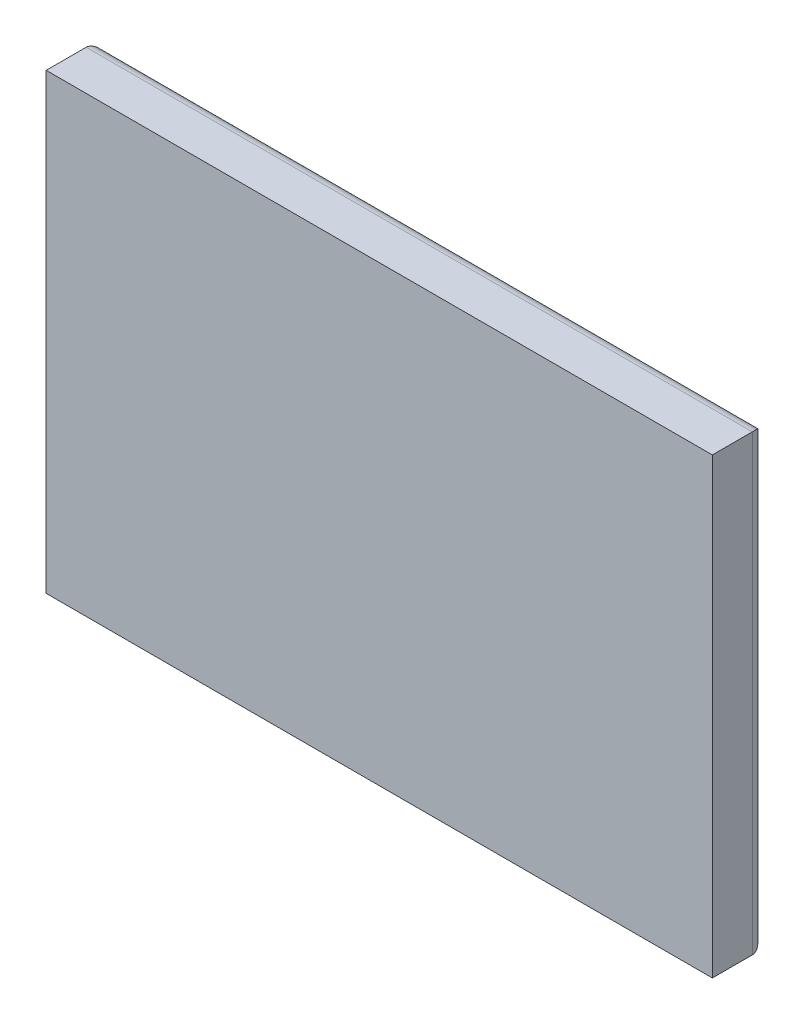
ISO-10303-21;
HEADER;
FILE_DESCRIPTION(('STEP AP214'),'2;1');
FILE_NAME('part.step','',(''),(''),'','','');
FILE_SCHEMA(('AUTOMOTIVE_DESIGN { 1 0 10303 214 1 1 1 1 }'));
ENDSEC;
DATA;
#1=APPLICATION_CONTEXT('core data for automotive mechanical design processes');
#2=APPLICATION_PROTOCOL_DEFINITION('international standard','automotive_design',2000,#1);
#3=PRODUCT_CONTEXT('',#1,'mechanical');
#4=PRODUCT('Part','Part','',(#3));
#5=PRODUCT_RELATED_PRODUCT_CATEGORY('part','',(#4));
#6=PRODUCT_DEFINITION_FORMATION('','',#4);
#7=PRODUCT_DEFINITION_CONTEXT('part definition',#1,'design');
#8=PRODUCT_DEFINITION('design','',#6,#7);
#9=PRODUCT_DEFINITION_SHAPE('','',#8);
#10=(LENGTH_UNIT() NAMED_UNIT(*) SI_UNIT(.MILLI.,.METRE.));
#11=(NAMED_UNIT(*) PLANE_ANGLE_UNIT() SI_UNIT($,.RADIAN.));
#12=(NAMED_UNIT(*) SI_UNIT($,.STERADIAN.) SOLID_ANGLE_UNIT());
#13=UNCERTAINTY_MEASURE_WITH_UNIT(LENGTH_MEASURE(1.E-05),#10,'distance_accuracy_value','');
#14=(GEOMETRIC_REPRESENTATION_CONTEXT(3) GLOBAL_UNCERTAINTY_ASSIGNED_CONTEXT((#13)) GLOBAL_UNIT_ASSIGNED_CONTEXT((#10,
#11,#12)) REPRESENTATION_CONTEXT('',''));
#15=CARTESIAN_POINT('',(0.,0.,0.));
#16=DIRECTION('',(0.,0.,1.));
#17=DIRECTION('',(1.,0.,0.));
#18=AXIS2_PLACEMENT_3D('',#15,#16,#17);
#19=CARTESIAN_POINT('',(15.875,-10.795,2.54));
#20=DIRECTION('',(-1.,0.,0.));
#21=DIRECTION('',(0.,0.,1.));
#22=AXIS2_PLACEMENT_3D('',#19,#20,#21);
#23=PLANE('',#22);
#24=DIRECTION('',(0.,0.,-1.));
#25=VECTOR('',#24,1.);
#26=CARTESIAN_POINT('',(15.875,-10.795,2.54));
#27=LINE('',#26,#25);
#28=CARTESIAN_POINT('',(15.875,-10.795,2.54));
#29=VERTEX_POINT('',#28);
#30=CARTESIAN_POINT('',(15.875,-10.795,0.635));
#31=VERTEX_POINT('',#30);
#32=EDGE_CURVE('E155',#29,#31,#27,.T.);
#33=ORIENTED_EDGE('',*,*,#32,.T.);
#34=DIRECTION('',(0.,1.,0.));
#35=VECTOR('',#34,1.);
#36=CARTESIAN_POINT('',(15.875,10.795,0.635));
#37=LINE('',#36,#35);
#38=CARTESIAN_POINT('',(15.875,10.795,0.635));
#39=VERTEX_POINT('',#38);
#40=EDGE_CURVE('E11',#31,#39,#37,.T.);
#41=ORIENTED_EDGE('',*,*,#40,.T.);
#42=DIRECTION('',(0.,0.,-1.));
#43=VECTOR('',#42,1.);
#44=CARTESIAN_POINT('',(15.875,10.795,2.54));
#45=LINE('',#44,#43);
#46=CARTESIAN_POINT('',(15.875,10.795,2.54));
#47=VERTEX_POINT('',#46);
#48=EDGE_CURVE('E94',#47,#39,#45,.T.);
#49=ORIENTED_EDGE('',*,*,#48,.F.);
#50=DIRECTION('',(0.,1.,0.));
#51=VECTOR('',#50,1.);
#52=CARTESIAN_POINT('',(15.875,-10.795,2.54));
#53=LINE('',#52,#51);
#54=EDGE_CURVE('E101',#29,#47,#53,.T.);
#55=ORIENTED_EDGE('',*,*,#54,.F.);
#56=EDGE_LOOP('',(#33,#41,#49,#55));
#57=FACE_BOUND('',#56,.T.);
#58=ADVANCED_FACE('F36',(#57),#23,.F.);
#59=CARTESIAN_POINT('',(-15.875,10.795,2.54));
#60=DIRECTION('',(0.,-1.,0.));
#61=DIRECTION('',(0.,0.,-1.));
#62=AXIS2_PLACEMENT_3D('',#59,#60,#61);
#63=PLANE('',#62);
#64=ORIENTED_EDGE('',*,*,#48,.T.);
#65=DIRECTION('',(-1.,0.,0.));
#66=VECTOR('',#65,1.);
#67=CARTESIAN_POINT('',(-15.875,10.795,0.635));
#68=LINE('',#67,#66);
#69=CARTESIAN_POINT('',(-15.875,10.795,0.635));
#70=VERTEX_POINT('',#69);
#71=EDGE_CURVE('E45',#39,#70,#68,.T.);
#72=ORIENTED_EDGE('',*,*,#71,.T.);
#73=DIRECTION('',(0.,0.,-1.));
#74=VECTOR('',#73,1.);
#75=CARTESIAN_POINT('',(-15.875,10.795,2.54));
#76=LINE('',#75,#74);
#77=CARTESIAN_POINT('',(-15.875,10.795,2.54));
#78=VERTEX_POINT('',#77);
#79=EDGE_CURVE('E97',#78,#70,#76,.T.);
#80=ORIENTED_EDGE('',*,*,#79,.F.);
#81=DIRECTION('',(-1.,0.,0.));
#82=VECTOR('',#81,1.);
#83=CARTESIAN_POINT('',(-15.875,10.795,2.54));
#84=LINE('',#83,#82);
#85=EDGE_CURVE('E91',#47,#78,#84,.T.);
#86=ORIENTED_EDGE('',*,*,#85,.F.);
#87=EDGE_LOOP('',(#64,#72,#80,#86));
#88=FACE_BOUND('',#87,.T.);
#89=ADVANCED_FACE('F93',(#88),#63,.F.);
#90=CARTESIAN_POINT('',(-15.875,-10.795,2.54));
#91=DIRECTION('',(1.,0.,0.));
#92=DIRECTION('',(0.,0.,-1.));
#93=AXIS2_PLACEMENT_3D('',#90,#91,#92);
#94=PLANE('',#93);
#95=ORIENTED_EDGE('',*,*,#79,.T.);
#96=DIRECTION('',(0.,-1.,0.));
#97=VECTOR('',#96,1.);
#98=CARTESIAN_POINT('',(-15.875,-10.795,0.635));
#99=LINE('',#98,#97);
#100=CARTESIAN_POINT('',(-15.875,-10.795,0.635));
#101=VERTEX_POINT('',#100);
#102=EDGE_CURVE('E108',#70,#101,#99,.T.);
#103=ORIENTED_EDGE('',*,*,#102,.T.);
#104=DIRECTION('',(0.,0.,-1.));
#105=VECTOR('',#104,1.);
#106=CARTESIAN_POINT('',(-15.875,-10.795,2.54));
#107=LINE('',#106,#105);
#108=CARTESIAN_POINT('',(-15.875,-10.795,2.54));
#109=VERTEX_POINT('',#108);
#110=EDGE_CURVE('E113',#109,#101,#107,.T.);
#111=ORIENTED_EDGE('',*,*,#110,.F.);
#112=DIRECTION('',(0.,-1.,0.));
#113=VECTOR('',#112,1.);
#114=CARTESIAN_POINT('',(-15.875,-10.795,2.54));
#115=LINE('',#114,#113);
#116=EDGE_CURVE('E100',#78,#109,#115,.T.);
#117=ORIENTED_EDGE('',*,*,#116,.F.);
#118=EDGE_LOOP('',(#95,#103,#111,#117));
#119=FACE_BOUND('',#118,.T.);
#120=ADVANCED_FACE('F153',(#119),#94,.F.);
#121=CARTESIAN_POINT('',(-15.875,-10.795,2.54));
#122=DIRECTION('',(0.,1.,0.));
#123=DIRECTION('',(0.,0.,1.));
#124=AXIS2_PLACEMENT_3D('',#121,#122,#123);
#125=PLANE('',#124);
#126=ORIENTED_EDGE('',*,*,#110,.T.);
#127=DIRECTION('',(1.,0.,0.));
#128=VECTOR('',#127,1.);
#129=CARTESIAN_POINT('',(15.875,-10.795,0.635));
#130=LINE('',#129,#128);
#131=EDGE_CURVE('E59',#101,#31,#130,.T.);
#132=ORIENTED_EDGE('',*,*,#131,.T.);
#133=ORIENTED_EDGE('',*,*,#32,.F.);
#134=DIRECTION('',(1.,0.,0.));
#135=VECTOR('',#134,1.);
#136=CARTESIAN_POINT('',(-15.875,-10.795,2.54));
#137=LINE('',#136,#135);
#138=EDGE_CURVE('E106',#109,#29,#137,.T.);
#139=ORIENTED_EDGE('',*,*,#138,.F.);
#140=EDGE_LOOP('',(#126,#132,#133,#139));
#141=FACE_BOUND('',#140,.T.);
#142=ADVANCED_FACE('F154',(#141),#125,.F.);
#143=CARTESIAN_POINT('',(0.,0.,2.54));
#144=DIRECTION('',(0.,0.,-1.));
#145=DIRECTION('',(-1.,0.,0.));
#146=AXIS2_PLACEMENT_3D('',#143,#144,#145);
#147=PLANE('',#146);
#148=ORIENTED_EDGE('',*,*,#54,.T.);
#149=ORIENTED_EDGE('',*,*,#85,.T.);
#150=ORIENTED_EDGE('',*,*,#116,.T.);
#151=ORIENTED_EDGE('',*,*,#138,.T.);
#152=EDGE_LOOP('',(#148,#149,#150,#151));
#153=FACE_BOUND('',#152,.T.);
#154=ADVANCED_FACE('F104',(#153),#147,.F.);
#155=CARTESIAN_POINT('',(0.,0.,0.));
#156=DIRECTION('',(0.,0.,-1.));
#157=DIRECTION('',(-1.,0.,0.));
#158=AXIS2_PLACEMENT_3D('',#155,#156,#157);
#159=PLANE('',#158);
#160=DIRECTION('',(1.,0.,0.));
#161=VECTOR('',#160,1.);
#162=CARTESIAN_POINT('',(-15.875,-10.16,0.));
#163=LINE('',#162,#161);
#164=CARTESIAN_POINT('',(15.24,-10.16,0.));
#165=VERTEX_POINT('',#164);
#166=CARTESIAN_POINT('',(-15.24,-10.16,0.));
#167=VERTEX_POINT('',#166);
#168=EDGE_CURVE('E120',#165,#167,#163,.F.);
#169=ORIENTED_EDGE('',*,*,#168,.T.);
#170=DIRECTION('',(0.,-1.,0.));
#171=VECTOR('',#170,1.);
#172=CARTESIAN_POINT('',(-15.24,10.795,0.));
#173=LINE('',#172,#171);
#174=CARTESIAN_POINT('',(-15.24,10.16,0.));
#175=VERTEX_POINT('',#174);
#176=EDGE_CURVE('E122',#167,#175,#173,.F.);
#177=ORIENTED_EDGE('',*,*,#176,.T.);
#178=DIRECTION('',(-1.,0.,0.));
#179=VECTOR('',#178,1.);
#180=CARTESIAN_POINT('',(15.875,10.16,0.));
#181=LINE('',#180,#179);
#182=CARTESIAN_POINT('',(15.24,10.16,0.));
#183=VERTEX_POINT('',#182);
#184=EDGE_CURVE('E118',#175,#183,#181,.F.);
#185=ORIENTED_EDGE('',*,*,#184,.T.);
#186=DIRECTION('',(0.,1.,0.));
#187=VECTOR('',#186,1.);
#188=CARTESIAN_POINT('',(15.24,-10.795,0.));
#189=LINE('',#188,#187);
#190=EDGE_CURVE('E111',#183,#165,#189,.F.);
#191=ORIENTED_EDGE('',*,*,#190,.T.);
#192=EDGE_LOOP('',(#169,#177,#185,#191));
#193=FACE_BOUND('',#192,.T.);
#194=ADVANCED_FACE('F144',(#193),#159,.T.);
#195=CARTESIAN_POINT('',(15.24,-10.795,0.635));
#196=DIRECTION('',(0.,-1.,0.));
#197=DIRECTION('',(0.,0.,-1.));
#198=AXIS2_PLACEMENT_3D('',#195,#196,#197);
#199=CYLINDRICAL_SURFACE('',#198,0.635);
#200=CARTESIAN_POINT('',(15.24,-10.16,0.635));
#201=DIRECTION('',(-0.707106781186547,-0.707106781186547,0.));
#202=DIRECTION('',(0.707106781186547,-0.707106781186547,0.));
#203=AXIS2_PLACEMENT_3D('',#200,#201,#202);
#204=ELLIPSE('',#203,0.898025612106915,0.635);
#205=EDGE_CURVE('E130',#165,#31,#204,.T.);
#206=ORIENTED_EDGE('',*,*,#205,.F.);
#207=ORIENTED_EDGE('',*,*,#190,.F.);
#208=CARTESIAN_POINT('',(15.24,10.16,0.635));
#209=DIRECTION('',(0.707106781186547,-0.707106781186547,0.));
#210=DIRECTION('',(-0.707106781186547,-0.707106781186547,0.));
#211=AXIS2_PLACEMENT_3D('',#208,#209,#210);
#212=ELLIPSE('',#211,0.898025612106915,0.635);
#213=EDGE_CURVE('E40',#39,#183,#212,.F.);
#214=ORIENTED_EDGE('',*,*,#213,.F.);
#215=ORIENTED_EDGE('',*,*,#40,.F.);
#216=EDGE_LOOP('',(#206,#207,#214,#215));
#217=FACE_BOUND('',#216,.T.);
#218=ADVANCED_FACE('F38',(#217),#199,.T.);
#219=CARTESIAN_POINT('',(-15.875,10.16,0.635));
#220=DIRECTION('',(1.,0.,0.));
#221=DIRECTION('',(0.,0.,-1.));
#222=AXIS2_PLACEMENT_3D('',#219,#220,#221);
#223=CYLINDRICAL_SURFACE('',#222,0.635);
#224=ORIENTED_EDGE('',*,*,#213,.T.);
#225=ORIENTED_EDGE('',*,*,#184,.F.);
#226=CARTESIAN_POINT('',(-15.24,10.16,0.635));
#227=DIRECTION('',(0.707106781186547,0.707106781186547,0.));
#228=DIRECTION('',(0.707106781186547,-0.707106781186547,0.));
#229=AXIS2_PLACEMENT_3D('',#226,#227,#228);
#230=ELLIPSE('',#229,0.898025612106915,0.635);
#231=EDGE_CURVE('E129',#70,#175,#230,.F.);
#232=ORIENTED_EDGE('',*,*,#231,.F.);
#233=ORIENTED_EDGE('',*,*,#71,.F.);
#234=EDGE_LOOP('',(#224,#225,#232,#233));
#235=FACE_BOUND('',#234,.T.);
#236=ADVANCED_FACE('F139',(#235),#223,.T.);
#237=CARTESIAN_POINT('',(-15.875,-10.16,0.635));
#238=DIRECTION('',(-1.,0.,0.));
#239=DIRECTION('',(0.,0.,1.));
#240=AXIS2_PLACEMENT_3D('',#237,#238,#239);
#241=CYLINDRICAL_SURFACE('',#240,0.635);
#242=ORIENTED_EDGE('',*,*,#205,.T.);
#243=ORIENTED_EDGE('',*,*,#131,.F.);
#244=CARTESIAN_POINT('',(-15.24,-10.16,0.635));
#245=DIRECTION('',(-0.707106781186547,0.707106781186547,0.));
#246=DIRECTION('',(-0.707106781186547,-0.707106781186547,0.));
#247=AXIS2_PLACEMENT_3D('',#244,#245,#246);
#248=ELLIPSE('',#247,0.898025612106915,0.635);
#249=EDGE_CURVE('E127',#167,#101,#248,.T.);
#250=ORIENTED_EDGE('',*,*,#249,.F.);
#251=ORIENTED_EDGE('',*,*,#168,.F.);
#252=EDGE_LOOP('',(#242,#243,#250,#251));
#253=FACE_BOUND('',#252,.T.);
#254=ADVANCED_FACE('F150',(#253),#241,.T.);
#255=CARTESIAN_POINT('',(-15.24,-10.795,0.635));
#256=DIRECTION('',(0.,1.,0.));
#257=DIRECTION('',(0.,0.,1.));
#258=AXIS2_PLACEMENT_3D('',#255,#256,#257);
#259=CYLINDRICAL_SURFACE('',#258,0.635);
#260=ORIENTED_EDGE('',*,*,#231,.T.);
#261=ORIENTED_EDGE('',*,*,#176,.F.);
#262=ORIENTED_EDGE('',*,*,#249,.T.);
#263=ORIENTED_EDGE('',*,*,#102,.F.);
#264=EDGE_LOOP('',(#260,#261,#262,#263));
#265=FACE_BOUND('',#264,.T.);
#266=ADVANCED_FACE('F148',(#265),#259,.T.);
#267=CLOSED_SHELL('',(#58,#89,#120,#142,#154,#194,#218,#236,#254,#266));
#268=MANIFOLD_SOLID_BREP('B2',#267);
#269=ADVANCED_BREP_SHAPE_REPRESENTATION('',(#18,#268),#14);
#270=SHAPE_DEFINITION_REPRESENTATION(#9,#269);
ENDSEC;
END-ISO-10303-21;
